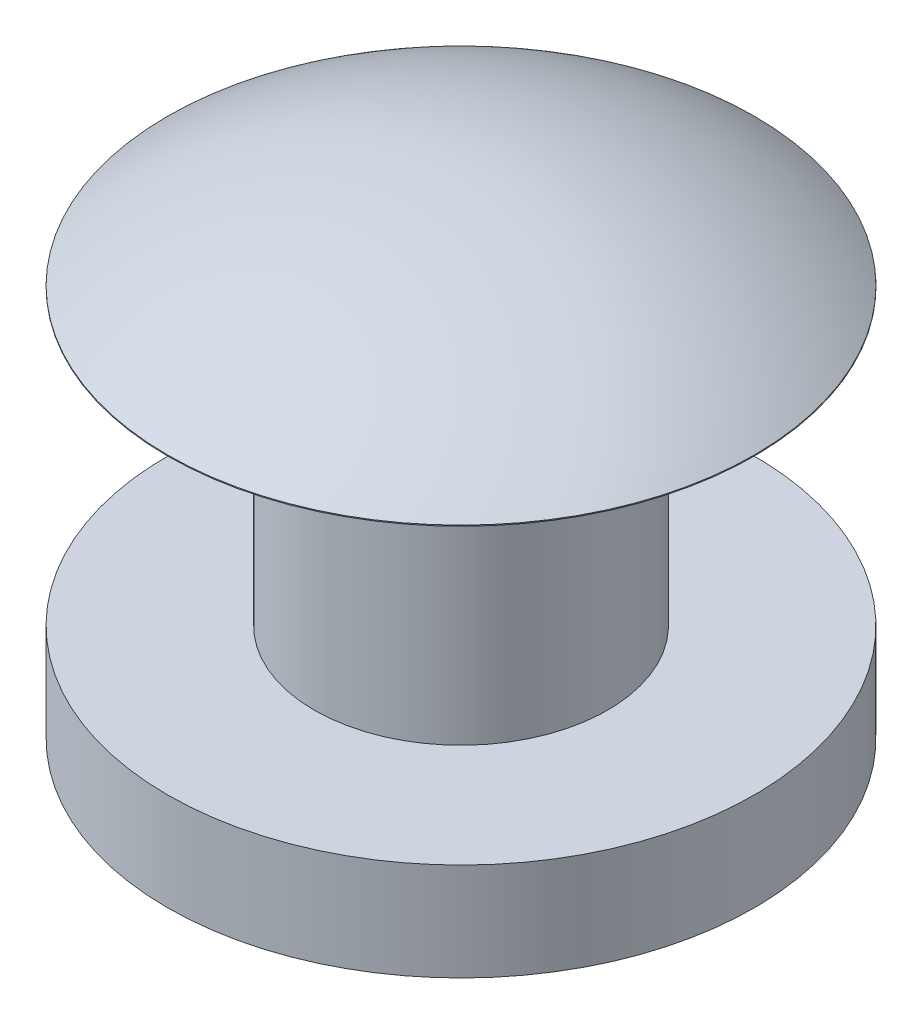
ISO-10303-21;
HEADER;
FILE_DESCRIPTION(('STEP AP214'),'2;1');
FILE_NAME('part.step','',(''),(''),'','','');
FILE_SCHEMA(('AUTOMOTIVE_DESIGN { 1 0 10303 214 1 1 1 1 }'));
ENDSEC;
DATA;
#1=APPLICATION_CONTEXT('core data for automotive mechanical design processes');
#2=APPLICATION_PROTOCOL_DEFINITION('international standard','automotive_design',2000,#1);
#3=PRODUCT_CONTEXT('',#1,'mechanical');
#4=PRODUCT('Part','Part','',(#3));
#5=PRODUCT_RELATED_PRODUCT_CATEGORY('part','',(#4));
#6=PRODUCT_DEFINITION_FORMATION('','',#4);
#7=PRODUCT_DEFINITION_CONTEXT('part definition',#1,'design');
#8=PRODUCT_DEFINITION('design','',#6,#7);
#9=PRODUCT_DEFINITION_SHAPE('','',#8);
#10=(LENGTH_UNIT() NAMED_UNIT(*) SI_UNIT(.MILLI.,.METRE.));
#11=(NAMED_UNIT(*) PLANE_ANGLE_UNIT() SI_UNIT($,.RADIAN.));
#12=(NAMED_UNIT(*) SI_UNIT($,.STERADIAN.) SOLID_ANGLE_UNIT());
#13=UNCERTAINTY_MEASURE_WITH_UNIT(LENGTH_MEASURE(1.E-05),#10,'distance_accuracy_value','');
#14=(GEOMETRIC_REPRESENTATION_CONTEXT(3) GLOBAL_UNCERTAINTY_ASSIGNED_CONTEXT((#13)) GLOBAL_UNIT_ASSIGNED_CONTEXT((#10,
#11,#12)) REPRESENTATION_CONTEXT('',''));
#15=CARTESIAN_POINT('',(0.,0.,0.));
#16=DIRECTION('',(0.,0.,1.));
#17=DIRECTION('',(1.,0.,0.));
#18=AXIS2_PLACEMENT_3D('',#15,#16,#17);
#19=CARTESIAN_POINT('',(-1.5,4.,0.));
#20=DIRECTION('',(0.,-1.,0.));
#21=DIRECTION('',(0.,0.,-1.));
#22=AXIS2_PLACEMENT_3D('',#19,#20,#21);
#23=PLANE('',#22);
#24=CARTESIAN_POINT('',(0.,4.,0.));
#25=DIRECTION('',(0.,1.,0.));
#26=DIRECTION('',(0.,0.,1.));
#27=AXIS2_PLACEMENT_3D('',#24,#25,#26);
#28=CIRCLE('',#27,1.5);
#29=CARTESIAN_POINT('',(0.,4.,1.5));
#30=VERTEX_POINT('',#29);
#31=EDGE_CURVE('E53',#30,#30,#28,.T.);
#32=ORIENTED_EDGE('',*,*,#31,.T.);
#33=EDGE_LOOP('',(#32));
#34=FACE_BOUND('',#33,.T.);
#35=CARTESIAN_POINT('',(0.,4.,0.));
#36=DIRECTION('',(0.,1.,0.));
#37=DIRECTION('',(0.,0.,1.));
#38=AXIS2_PLACEMENT_3D('',#35,#36,#37);
#39=CIRCLE('',#38,3.);
#40=CARTESIAN_POINT('',(0.,4.,3.));
#41=VERTEX_POINT('',#40);
#42=EDGE_CURVE('E10',#41,#41,#39,.T.);
#43=ORIENTED_EDGE('',*,*,#42,.F.);
#44=EDGE_LOOP('',(#43));
#45=FACE_BOUND('',#44,.T.);
#46=ADVANCED_FACE('F31',(#34,#45),#23,.T.);
#47=CARTESIAN_POINT('',(0.,12.258894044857,0.));
#48=DIRECTION('',(0.,1.,0.));
#49=DIRECTION('',(0.,0.,1.));
#50=AXIS2_PLACEMENT_3D('',#47,#48,#49);
#51=CYLINDRICAL_SURFACE('',#50,3.);
#52=ORIENTED_EDGE('',*,*,#42,.T.);
#53=EDGE_LOOP('',(#52));
#54=FACE_BOUND('',#53,.T.);
#55=CARTESIAN_POINT('',(0.,4.01,0.));
#56=DIRECTION('',(0.,1.,0.));
#57=DIRECTION('',(0.,0.,1.));
#58=AXIS2_PLACEMENT_3D('',#55,#56,#57);
#59=CIRCLE('',#58,3.);
#60=CARTESIAN_POINT('',(0.,4.01,3.));
#61=VERTEX_POINT('',#60);
#62=EDGE_CURVE('E37',#61,#61,#59,.T.);
#63=ORIENTED_EDGE('',*,*,#62,.F.);
#64=EDGE_LOOP('',(#63));
#65=FACE_BOUND('',#64,.T.);
#66=ADVANCED_FACE('F71',(#54,#65),#51,.T.);
#67=CARTESIAN_POINT('',(0.,0.,0.));
#68=DIRECTION('',(0.,1.,0.));
#69=DIRECTION('',(1.,0.,0.));
#70=AXIS2_PLACEMENT_3D('',#67,#68,#69);
#71=SPHERICAL_SURFACE('',#70,5.00800359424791);
#72=ORIENTED_EDGE('',*,*,#62,.T.);
#73=EDGE_LOOP('',(#72));
#74=FACE_BOUND('',#73,.T.);
#75=ADVANCED_FACE('F75',(#74),#71,.T.);
#76=CARTESIAN_POINT('',(-3.,0.,0.));
#77=DIRECTION('',(0.,-1.,0.));
#78=DIRECTION('',(0.,0.,-1.));
#79=AXIS2_PLACEMENT_3D('',#76,#77,#78);
#80=PLANE('',#79);
#81=CARTESIAN_POINT('',(0.,0.,0.));
#82=DIRECTION('',(0.,1.,0.));
#83=DIRECTION('',(0.,0.,1.));
#84=AXIS2_PLACEMENT_3D('',#81,#82,#83);
#85=CIRCLE('',#84,3.);
#86=CARTESIAN_POINT('',(0.,0.,3.));
#87=VERTEX_POINT('',#86);
#88=EDGE_CURVE('E41',#87,#87,#85,.T.);
#89=ORIENTED_EDGE('',*,*,#88,.F.);
#90=EDGE_LOOP('',(#89));
#91=FACE_BOUND('',#90,.T.);
#92=ADVANCED_FACE('F79',(#91),#80,.T.);
#93=CARTESIAN_POINT('',(0.,12.258894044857,0.));
#94=DIRECTION('',(0.,1.,0.));
#95=DIRECTION('',(0.,0.,1.));
#96=AXIS2_PLACEMENT_3D('',#93,#94,#95);
#97=CYLINDRICAL_SURFACE('',#96,3.);
#98=ORIENTED_EDGE('',*,*,#88,.T.);
#99=EDGE_LOOP('',(#98));
#100=FACE_BOUND('',#99,.T.);
#101=CARTESIAN_POINT('',(0.,0.999999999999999,0.));
#102=DIRECTION('',(0.,1.,0.));
#103=DIRECTION('',(0.,0.,1.));
#104=AXIS2_PLACEMENT_3D('',#101,#102,#103);
#105=CIRCLE('',#104,3.);
#106=CARTESIAN_POINT('',(0.,0.999999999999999,3.));
#107=VERTEX_POINT('',#106);
#108=EDGE_CURVE('E45',#107,#107,#105,.T.);
#109=ORIENTED_EDGE('',*,*,#108,.F.);
#110=EDGE_LOOP('',(#109));
#111=FACE_BOUND('',#110,.T.);
#112=ADVANCED_FACE('F67',(#100,#111),#97,.T.);
#113=CARTESIAN_POINT('',(-1.5,1.,0.));
#114=DIRECTION('',(0.,1.,0.));
#115=DIRECTION('',(0.,0.,1.));
#116=AXIS2_PLACEMENT_3D('',#113,#114,#115);
#117=PLANE('',#116);
#118=ORIENTED_EDGE('',*,*,#108,.T.);
#119=EDGE_LOOP('',(#118));
#120=FACE_BOUND('',#119,.T.);
#121=CARTESIAN_POINT('',(0.,1.,0.));
#122=DIRECTION('',(0.,1.,0.));
#123=DIRECTION('',(0.,0.,1.));
#124=AXIS2_PLACEMENT_3D('',#121,#122,#123);
#125=CIRCLE('',#124,1.5);
#126=CARTESIAN_POINT('',(0.,1.,1.5));
#127=VERTEX_POINT('',#126);
#128=EDGE_CURVE('E50',#127,#127,#125,.T.);
#129=ORIENTED_EDGE('',*,*,#128,.F.);
#130=EDGE_LOOP('',(#129));
#131=FACE_BOUND('',#130,.T.);
#132=ADVANCED_FACE('F61',(#120,#131),#117,.T.);
#133=CARTESIAN_POINT('',(0.,12.258894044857,0.));
#134=DIRECTION('',(0.,1.,0.));
#135=DIRECTION('',(0.,0.,1.));
#136=AXIS2_PLACEMENT_3D('',#133,#134,#135);
#137=CYLINDRICAL_SURFACE('',#136,1.5);
#138=ORIENTED_EDGE('',*,*,#128,.T.);
#139=EDGE_LOOP('',(#138));
#140=FACE_BOUND('',#139,.T.);
#141=ORIENTED_EDGE('',*,*,#31,.F.);
#142=EDGE_LOOP('',(#141));
#143=FACE_BOUND('',#142,.T.);
#144=ADVANCED_FACE('F59',(#140,#143),#137,.T.);
#145=CLOSED_SHELL('',(#46,#66,#75,#92,#112,#132,#144));
#146=MANIFOLD_SOLID_BREP('B2',#145);
#147=ADVANCED_BREP_SHAPE_REPRESENTATION('',(#18,#146),#14);
#148=SHAPE_DEFINITION_REPRESENTATION(#9,#147);
ENDSEC;
END-ISO-10303-21;
